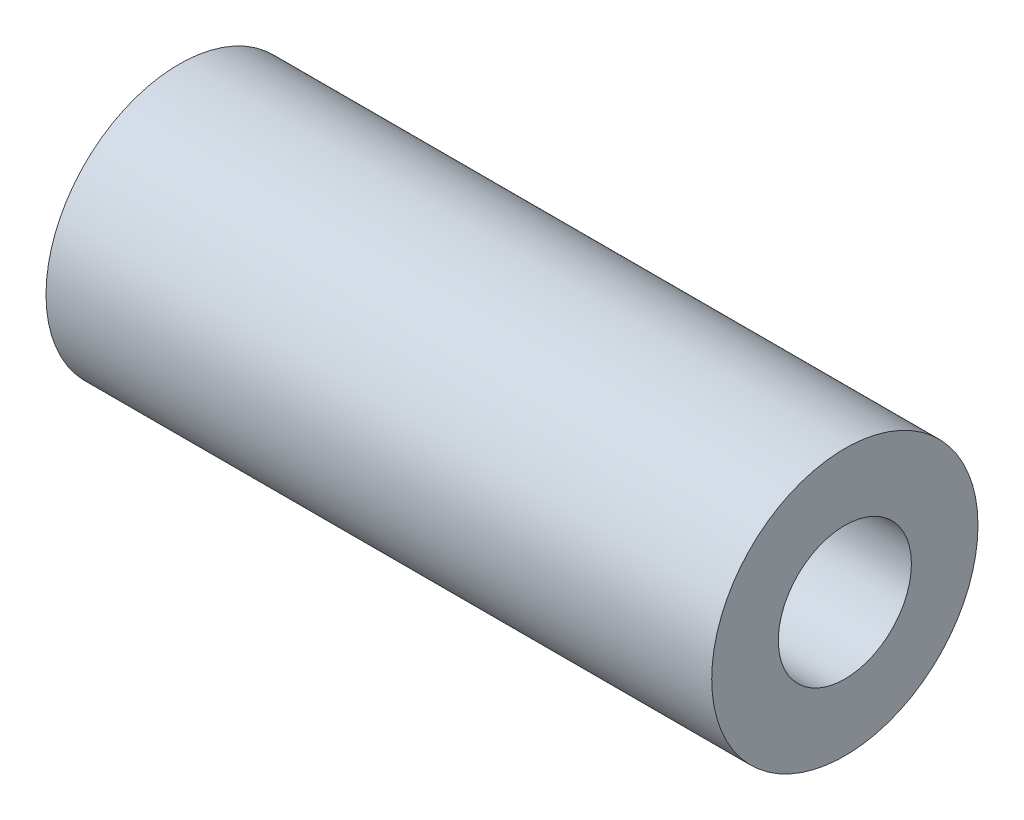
from build123d import *

# Parameters (mm, degrees)
ESQUISSE1_R          = 5
ESQUISSE1_R_2        = 2.5
BASE_EXTRUSION_DEPTH = 25


with BuildPart() as part:
    # Esquisse1 → Base-Extrusion (new body)
    with BuildSketch(Plane(origin=(0, 0, 0), x_dir=(0, 0, -1), z_dir=(1, 0, 0))):
        Circle(ESQUISSE1_R)
        Circle(ESQUISSE1_R_2, mode=Mode.SUBTRACT)
    extrude(amount=BASE_EXTRUSION_DEPTH)


solid = part.part
